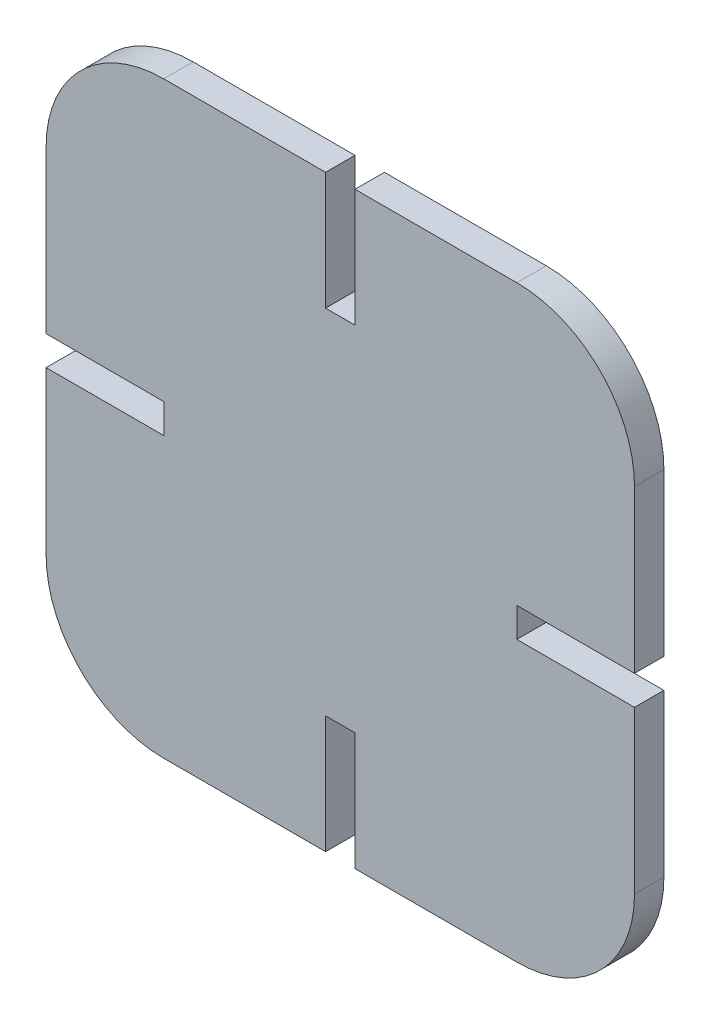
ISO-10303-21;
HEADER;
FILE_DESCRIPTION(('STEP AP214'),'2;1');
FILE_NAME('part.step','',(''),(''),'','','');
FILE_SCHEMA(('AUTOMOTIVE_DESIGN { 1 0 10303 214 1 1 1 1 }'));
ENDSEC;
DATA;
#1=APPLICATION_CONTEXT('core data for automotive mechanical design processes');
#2=APPLICATION_PROTOCOL_DEFINITION('international standard','automotive_design',2000,#1);
#3=PRODUCT_CONTEXT('',#1,'mechanical');
#4=PRODUCT('Part','Part','',(#3));
#5=PRODUCT_RELATED_PRODUCT_CATEGORY('part','',(#4));
#6=PRODUCT_DEFINITION_FORMATION('','',#4);
#7=PRODUCT_DEFINITION_CONTEXT('part definition',#1,'design');
#8=PRODUCT_DEFINITION('design','',#6,#7);
#9=PRODUCT_DEFINITION_SHAPE('','',#8);
#10=(LENGTH_UNIT() NAMED_UNIT(*) SI_UNIT(.MILLI.,.METRE.));
#11=(NAMED_UNIT(*) PLANE_ANGLE_UNIT() SI_UNIT($,.RADIAN.));
#12=(NAMED_UNIT(*) SI_UNIT($,.STERADIAN.) SOLID_ANGLE_UNIT());
#13=UNCERTAINTY_MEASURE_WITH_UNIT(LENGTH_MEASURE(1.E-05),#10,'distance_accuracy_value','');
#14=(GEOMETRIC_REPRESENTATION_CONTEXT(3) GLOBAL_UNCERTAINTY_ASSIGNED_CONTEXT((#13)) GLOBAL_UNIT_ASSIGNED_CONTEXT((#10,
#11,#12)) REPRESENTATION_CONTEXT('',''));
#15=CARTESIAN_POINT('',(0.,0.,0.));
#16=DIRECTION('',(0.,0.,1.));
#17=DIRECTION('',(1.,0.,0.));
#18=AXIS2_PLACEMENT_3D('',#15,#16,#17);
#19=CARTESIAN_POINT('',(-25.,15.,2.5));
#20=DIRECTION('',(1.,0.,0.));
#21=DIRECTION('',(0.,1.,0.));
#22=AXIS2_PLACEMENT_3D('',#19,#20,#21);
#23=PLANE('',#22);
#24=DIRECTION('',(0.,-1.,0.));
#25=VECTOR('',#24,1.);
#26=CARTESIAN_POINT('',(-25.,15.,2.5));
#27=LINE('',#26,#25);
#28=CARTESIAN_POINT('',(-24.9999999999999,-1.25000000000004,2.5));
#29=VERTEX_POINT('',#28);
#30=CARTESIAN_POINT('',(-25.,-15.,2.5));
#31=VERTEX_POINT('',#30);
#32=EDGE_CURVE('E308',#29,#31,#27,.T.);
#33=ORIENTED_EDGE('',*,*,#32,.F.);
#34=DIRECTION('',(0.,0.,1.));
#35=VECTOR('',#34,1.);
#36=CARTESIAN_POINT('',(-24.9999999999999,-1.25000000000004,0.));
#37=LINE('',#36,#35);
#38=CARTESIAN_POINT('',(-24.9999999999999,-1.25000000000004,0.));
#39=VERTEX_POINT('',#38);
#40=EDGE_CURVE('E275',#39,#29,#37,.T.);
#41=ORIENTED_EDGE('',*,*,#40,.F.);
#42=DIRECTION('',(0.,-1.,0.));
#43=VECTOR('',#42,1.);
#44=CARTESIAN_POINT('',(-25.,15.,0.));
#45=LINE('',#44,#43);
#46=CARTESIAN_POINT('',(-25.,-15.,0.));
#47=VERTEX_POINT('',#46);
#48=EDGE_CURVE('E337',#39,#47,#45,.T.);
#49=ORIENTED_EDGE('',*,*,#48,.T.);
#50=DIRECTION('',(0.,0.,-1.));
#51=VECTOR('',#50,1.);
#52=CARTESIAN_POINT('',(-25.,-15.,2.5));
#53=LINE('',#52,#51);
#54=EDGE_CURVE('E41',#31,#47,#53,.T.);
#55=ORIENTED_EDGE('',*,*,#54,.F.);
#56=EDGE_LOOP('',(#33,#41,#49,#55));
#57=FACE_BOUND('',#56,.T.);
#58=ADVANCED_FACE('F33',(#57),#23,.F.);
#59=CARTESIAN_POINT('',(-15.,-25.,2.5));
#60=DIRECTION('',(0.,1.,0.));
#61=DIRECTION('',(0.,0.,1.));
#62=AXIS2_PLACEMENT_3D('',#59,#60,#61);
#63=PLANE('',#62);
#64=DIRECTION('',(1.,0.,0.));
#65=VECTOR('',#64,1.);
#66=CARTESIAN_POINT('',(-15.,-25.,2.5));
#67=LINE('',#66,#65);
#68=CARTESIAN_POINT('',(1.25,-25.,2.5));
#69=VERTEX_POINT('',#68);
#70=CARTESIAN_POINT('',(15.,-25.,2.5));
#71=VERTEX_POINT('',#70);
#72=EDGE_CURVE('E316',#69,#71,#67,.T.);
#73=ORIENTED_EDGE('',*,*,#72,.F.);
#74=DIRECTION('',(0.,0.,1.));
#75=VECTOR('',#74,1.);
#76=CARTESIAN_POINT('',(1.25,-25.,0.));
#77=LINE('',#76,#75);
#78=CARTESIAN_POINT('',(1.25,-25.,0.));
#79=VERTEX_POINT('',#78);
#80=EDGE_CURVE('E253',#79,#69,#77,.T.);
#81=ORIENTED_EDGE('',*,*,#80,.F.);
#82=DIRECTION('',(1.,0.,0.));
#83=VECTOR('',#82,1.);
#84=CARTESIAN_POINT('',(-15.,-25.,0.));
#85=LINE('',#84,#83);
#86=CARTESIAN_POINT('',(15.,-25.,0.));
#87=VERTEX_POINT('',#86);
#88=EDGE_CURVE('E344',#79,#87,#85,.T.);
#89=ORIENTED_EDGE('',*,*,#88,.T.);
#90=DIRECTION('',(0.,0.,-1.));
#91=VECTOR('',#90,1.);
#92=CARTESIAN_POINT('',(15.,-25.,2.5));
#93=LINE('',#92,#91);
#94=EDGE_CURVE('E369',#71,#87,#93,.T.);
#95=ORIENTED_EDGE('',*,*,#94,.F.);
#96=EDGE_LOOP('',(#73,#81,#89,#95));
#97=FACE_BOUND('',#96,.T.);
#98=ADVANCED_FACE('F413',(#97),#63,.F.);
#99=CARTESIAN_POINT('',(25.,15.,2.5));
#100=DIRECTION('',(1.,0.,0.));
#101=DIRECTION('',(0.,1.,0.));
#102=AXIS2_PLACEMENT_3D('',#99,#100,#101);
#103=PLANE('',#102);
#104=DIRECTION('',(0.,0.,1.));
#105=VECTOR('',#104,1.);
#106=CARTESIAN_POINT('',(24.9999999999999,1.24999999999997,0.));
#107=LINE('',#106,#105);
#108=CARTESIAN_POINT('',(24.9999999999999,1.24999999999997,0.));
#109=VERTEX_POINT('',#108);
#110=CARTESIAN_POINT('',(24.9999999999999,1.24999999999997,2.5));
#111=VERTEX_POINT('',#110);
#112=EDGE_CURVE('E231',#109,#111,#107,.T.);
#113=ORIENTED_EDGE('',*,*,#112,.F.);
#114=DIRECTION('',(0.,-1.,0.));
#115=VECTOR('',#114,1.);
#116=CARTESIAN_POINT('',(25.,15.,0.));
#117=LINE('',#116,#115);
#118=CARTESIAN_POINT('',(25.,15.,0.));
#119=VERTEX_POINT('',#118);
#120=EDGE_CURVE('E352',#119,#109,#117,.T.);
#121=ORIENTED_EDGE('',*,*,#120,.F.);
#122=DIRECTION('',(0.,0.,-1.));
#123=VECTOR('',#122,1.);
#124=CARTESIAN_POINT('',(25.,15.,2.5));
#125=LINE('',#124,#123);
#126=CARTESIAN_POINT('',(25.,15.,2.5));
#127=VERTEX_POINT('',#126);
#128=EDGE_CURVE('E364',#127,#119,#125,.T.);
#129=ORIENTED_EDGE('',*,*,#128,.F.);
#130=DIRECTION('',(0.,-1.,0.));
#131=VECTOR('',#130,1.);
#132=CARTESIAN_POINT('',(25.,15.,2.5));
#133=LINE('',#132,#131);
#134=EDGE_CURVE('E324',#127,#111,#133,.T.);
#135=ORIENTED_EDGE('',*,*,#134,.T.);
#136=EDGE_LOOP('',(#113,#121,#129,#135));
#137=FACE_BOUND('',#136,.T.);
#138=ADVANCED_FACE('F418',(#137),#103,.T.);
#139=CARTESIAN_POINT('',(-15.,25.,2.5));
#140=DIRECTION('',(0.,1.,0.));
#141=DIRECTION('',(0.,0.,1.));
#142=AXIS2_PLACEMENT_3D('',#139,#140,#141);
#143=PLANE('',#142);
#144=DIRECTION('',(0.,0.,1.));
#145=VECTOR('',#144,1.);
#146=CARTESIAN_POINT('',(1.25,24.9999999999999,0.));
#147=LINE('',#146,#145);
#148=CARTESIAN_POINT('',(1.25,24.9999999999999,0.));
#149=VERTEX_POINT('',#148);
#150=CARTESIAN_POINT('',(1.25,24.9999999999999,2.5));
#151=VERTEX_POINT('',#150);
#152=EDGE_CURVE('E289',#149,#151,#147,.T.);
#153=ORIENTED_EDGE('',*,*,#152,.T.);
#154=DIRECTION('',(1.,0.,0.));
#155=VECTOR('',#154,1.);
#156=CARTESIAN_POINT('',(-15.,25.,2.5));
#157=LINE('',#156,#155);
#158=CARTESIAN_POINT('',(15.,25.,2.5));
#159=VERTEX_POINT('',#158);
#160=EDGE_CURVE('E330',#151,#159,#157,.T.);
#161=ORIENTED_EDGE('',*,*,#160,.T.);
#162=DIRECTION('',(0.,0.,-1.));
#163=VECTOR('',#162,1.);
#164=CARTESIAN_POINT('',(15.,25.,2.5));
#165=LINE('',#164,#163);
#166=CARTESIAN_POINT('',(15.,25.,0.));
#167=VERTEX_POINT('',#166);
#168=EDGE_CURVE('E361',#159,#167,#165,.T.);
#169=ORIENTED_EDGE('',*,*,#168,.T.);
#170=DIRECTION('',(1.,0.,0.));
#171=VECTOR('',#170,1.);
#172=CARTESIAN_POINT('',(-15.,25.,0.));
#173=LINE('',#172,#171);
#174=EDGE_CURVE('E357',#149,#167,#173,.T.);
#175=ORIENTED_EDGE('',*,*,#174,.F.);
#176=EDGE_LOOP('',(#153,#161,#169,#175));
#177=FACE_BOUND('',#176,.T.);
#178=ADVANCED_FACE('F428',(#177),#143,.T.);
#179=CARTESIAN_POINT('',(-15.,15.,2.5));
#180=DIRECTION('',(0.,0.,-1.));
#181=DIRECTION('',(-1.,0.,0.));
#182=AXIS2_PLACEMENT_3D('',#179,#180,#181);
#183=CYLINDRICAL_SURFACE('',#182,10.);
#184=CARTESIAN_POINT('',(-15.,15.,0.));
#185=DIRECTION('',(0.,0.,1.));
#186=DIRECTION('',(1.,0.,0.));
#187=AXIS2_PLACEMENT_3D('',#184,#185,#186);
#188=CIRCLE('',#187,10.);
#189=CARTESIAN_POINT('',(-15.,25.,0.));
#190=VERTEX_POINT('',#189);
#191=CARTESIAN_POINT('',(-25.,15.,0.));
#192=VERTEX_POINT('',#191);
#193=EDGE_CURVE('E298',#190,#192,#188,.T.);
#194=ORIENTED_EDGE('',*,*,#193,.T.);
#195=DIRECTION('',(0.,0.,-1.));
#196=VECTOR('',#195,1.);
#197=CARTESIAN_POINT('',(-25.,15.,2.5));
#198=LINE('',#197,#196);
#199=CARTESIAN_POINT('',(-25.,15.,2.5));
#200=VERTEX_POINT('',#199);
#201=EDGE_CURVE('E11',#200,#192,#198,.T.);
#202=ORIENTED_EDGE('',*,*,#201,.F.);
#203=CARTESIAN_POINT('',(-15.,15.,2.5));
#204=DIRECTION('',(0.,0.,1.));
#205=DIRECTION('',(1.,0.,0.));
#206=AXIS2_PLACEMENT_3D('',#203,#204,#205);
#207=CIRCLE('',#206,10.);
#208=CARTESIAN_POINT('',(-15.,25.,2.5));
#209=VERTEX_POINT('',#208);
#210=EDGE_CURVE('E305',#209,#200,#207,.T.);
#211=ORIENTED_EDGE('',*,*,#210,.F.);
#212=DIRECTION('',(0.,0.,-1.));
#213=VECTOR('',#212,1.);
#214=CARTESIAN_POINT('',(-15.,25.,2.5));
#215=LINE('',#214,#213);
#216=EDGE_CURVE('E334',#209,#190,#215,.T.);
#217=ORIENTED_EDGE('',*,*,#216,.T.);
#218=EDGE_LOOP('',(#194,#202,#211,#217));
#219=FACE_BOUND('',#218,.T.);
#220=ADVANCED_FACE('F35',(#219),#183,.T.);
#221=CARTESIAN_POINT('',(-25.,1.24999999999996,0.));
#222=VERTEX_POINT('',#221);
#223=EDGE_CURVE('E338',#192,#222,#45,.T.);
#224=ORIENTED_EDGE('',*,*,#223,.T.);
#225=DIRECTION('',(0.,0.,1.));
#226=VECTOR('',#225,1.);
#227=CARTESIAN_POINT('',(-24.9999999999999,1.24999999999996,0.));
#228=LINE('',#227,#226);
#229=CARTESIAN_POINT('',(-24.9999999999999,1.24999999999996,2.5));
#230=VERTEX_POINT('',#229);
#231=EDGE_CURVE('E48',#222,#230,#228,.T.);
#232=ORIENTED_EDGE('',*,*,#231,.T.);
#233=EDGE_CURVE('E310',#200,#230,#27,.T.);
#234=ORIENTED_EDGE('',*,*,#233,.F.);
#235=ORIENTED_EDGE('',*,*,#201,.T.);
#236=EDGE_LOOP('',(#224,#232,#234,#235));
#237=FACE_BOUND('',#236,.T.);
#238=ADVANCED_FACE('F414',(#237),#23,.F.);
#239=CARTESIAN_POINT('',(-15.,-15.,2.5));
#240=DIRECTION('',(0.,0.,-1.));
#241=DIRECTION('',(-1.,0.,0.));
#242=AXIS2_PLACEMENT_3D('',#239,#240,#241);
#243=CYLINDRICAL_SURFACE('',#242,10.);
#244=CARTESIAN_POINT('',(-15.,-15.,0.));
#245=DIRECTION('',(0.,0.,-1.));
#246=DIRECTION('',(-1.,0.,0.));
#247=AXIS2_PLACEMENT_3D('',#244,#245,#246);
#248=CIRCLE('',#247,10.);
#249=CARTESIAN_POINT('',(-15.,-25.,0.));
#250=VERTEX_POINT('',#249);
#251=EDGE_CURVE('E341',#250,#47,#248,.T.);
#252=ORIENTED_EDGE('',*,*,#251,.F.);
#253=DIRECTION('',(0.,0.,-1.));
#254=VECTOR('',#253,1.);
#255=CARTESIAN_POINT('',(-15.,-25.,2.5));
#256=LINE('',#255,#254);
#257=CARTESIAN_POINT('',(-15.,-25.,2.5));
#258=VERTEX_POINT('',#257);
#259=EDGE_CURVE('E372',#258,#250,#256,.T.);
#260=ORIENTED_EDGE('',*,*,#259,.F.);
#261=CARTESIAN_POINT('',(-15.,-15.,2.5));
#262=DIRECTION('',(0.,0.,-1.));
#263=DIRECTION('',(-1.,0.,0.));
#264=AXIS2_PLACEMENT_3D('',#261,#262,#263);
#265=CIRCLE('',#264,10.);
#266=EDGE_CURVE('E313',#258,#31,#265,.T.);
#267=ORIENTED_EDGE('',*,*,#266,.T.);
#268=ORIENTED_EDGE('',*,*,#54,.T.);
#269=EDGE_LOOP('',(#252,#260,#267,#268));
#270=FACE_BOUND('',#269,.T.);
#271=ADVANCED_FACE('F377',(#270),#243,.T.);
#272=CARTESIAN_POINT('',(-1.25,-25.,0.));
#273=VERTEX_POINT('',#272);
#274=EDGE_CURVE('E345',#250,#273,#85,.T.);
#275=ORIENTED_EDGE('',*,*,#274,.T.);
#276=DIRECTION('',(0.,0.,1.));
#277=VECTOR('',#276,1.);
#278=CARTESIAN_POINT('',(-1.25,-25.,0.));
#279=LINE('',#278,#277);
#280=CARTESIAN_POINT('',(-1.25,-25.,2.5));
#281=VERTEX_POINT('',#280);
#282=EDGE_CURVE('E56',#273,#281,#279,.T.);
#283=ORIENTED_EDGE('',*,*,#282,.T.);
#284=EDGE_CURVE('E317',#258,#281,#67,.T.);
#285=ORIENTED_EDGE('',*,*,#284,.F.);
#286=ORIENTED_EDGE('',*,*,#259,.T.);
#287=EDGE_LOOP('',(#275,#283,#285,#286));
#288=FACE_BOUND('',#287,.T.);
#289=ADVANCED_FACE('F384',(#288),#63,.F.);
#290=CARTESIAN_POINT('',(15.,-15.,2.5));
#291=DIRECTION('',(0.,0.,-1.));
#292=DIRECTION('',(-1.,0.,0.));
#293=AXIS2_PLACEMENT_3D('',#290,#291,#292);
#294=CYLINDRICAL_SURFACE('',#293,10.);
#295=CARTESIAN_POINT('',(15.,-15.,0.));
#296=DIRECTION('',(0.,0.,-1.));
#297=DIRECTION('',(-1.,0.,0.));
#298=AXIS2_PLACEMENT_3D('',#295,#296,#297);
#299=CIRCLE('',#298,10.);
#300=CARTESIAN_POINT('',(25.,-15.,0.));
#301=VERTEX_POINT('',#300);
#302=EDGE_CURVE('E348',#301,#87,#299,.T.);
#303=ORIENTED_EDGE('',*,*,#302,.F.);
#304=DIRECTION('',(0.,0.,-1.));
#305=VECTOR('',#304,1.);
#306=CARTESIAN_POINT('',(25.,-15.,2.5));
#307=LINE('',#306,#305);
#308=CARTESIAN_POINT('',(25.,-15.,2.5));
#309=VERTEX_POINT('',#308);
#310=EDGE_CURVE('E366',#309,#301,#307,.T.);
#311=ORIENTED_EDGE('',*,*,#310,.F.);
#312=CARTESIAN_POINT('',(15.,-15.,2.5));
#313=DIRECTION('',(0.,0.,-1.));
#314=DIRECTION('',(-1.,0.,0.));
#315=AXIS2_PLACEMENT_3D('',#312,#313,#314);
#316=CIRCLE('',#315,10.);
#317=EDGE_CURVE('E320',#309,#71,#316,.T.);
#318=ORIENTED_EDGE('',*,*,#317,.T.);
#319=ORIENTED_EDGE('',*,*,#94,.T.);
#320=EDGE_LOOP('',(#303,#311,#318,#319));
#321=FACE_BOUND('',#320,.T.);
#322=ADVANCED_FACE('F470',(#321),#294,.T.);
#323=DIRECTION('',(0.,0.,1.));
#324=VECTOR('',#323,1.);
#325=CARTESIAN_POINT('',(24.9999999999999,-1.25000000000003,0.));
#326=LINE('',#325,#324);
#327=CARTESIAN_POINT('',(25.,-1.25000000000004,0.));
#328=VERTEX_POINT('',#327);
#329=CARTESIAN_POINT('',(24.9999999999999,-1.25000000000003,2.5));
#330=VERTEX_POINT('',#329);
#331=EDGE_CURVE('E206',#328,#330,#326,.T.);
#332=ORIENTED_EDGE('',*,*,#331,.T.);
#333=EDGE_CURVE('E323',#330,#309,#133,.T.);
#334=ORIENTED_EDGE('',*,*,#333,.T.);
#335=ORIENTED_EDGE('',*,*,#310,.T.);
#336=EDGE_CURVE('E351',#328,#301,#117,.T.);
#337=ORIENTED_EDGE('',*,*,#336,.F.);
#338=EDGE_LOOP('',(#332,#334,#335,#337));
#339=FACE_BOUND('',#338,.T.);
#340=ADVANCED_FACE('F465',(#339),#103,.T.);
#341=CARTESIAN_POINT('',(15.,15.,2.5));
#342=DIRECTION('',(0.,0.,-1.));
#343=DIRECTION('',(-1.,0.,0.));
#344=AXIS2_PLACEMENT_3D('',#341,#342,#343);
#345=CYLINDRICAL_SURFACE('',#344,10.);
#346=CARTESIAN_POINT('',(15.,15.,0.));
#347=DIRECTION('',(0.,0.,1.));
#348=DIRECTION('',(1.,0.,0.));
#349=AXIS2_PLACEMENT_3D('',#346,#347,#348);
#350=CIRCLE('',#349,10.);
#351=EDGE_CURVE('E354',#119,#167,#350,.T.);
#352=ORIENTED_EDGE('',*,*,#351,.T.);
#353=ORIENTED_EDGE('',*,*,#168,.F.);
#354=CARTESIAN_POINT('',(15.,15.,2.5));
#355=DIRECTION('',(0.,0.,1.));
#356=DIRECTION('',(1.,0.,0.));
#357=AXIS2_PLACEMENT_3D('',#354,#355,#356);
#358=CIRCLE('',#357,10.);
#359=EDGE_CURVE('E327',#127,#159,#358,.T.);
#360=ORIENTED_EDGE('',*,*,#359,.F.);
#361=ORIENTED_EDGE('',*,*,#128,.T.);
#362=EDGE_LOOP('',(#352,#353,#360,#361));
#363=FACE_BOUND('',#362,.T.);
#364=ADVANCED_FACE('F455',(#363),#345,.T.);
#365=DIRECTION('',(0.,0.,1.));
#366=VECTOR('',#365,1.);
#367=CARTESIAN_POINT('',(-1.25,24.9999999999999,0.));
#368=LINE('',#367,#366);
#369=CARTESIAN_POINT('',(-1.25,24.9999999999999,0.));
#370=VERTEX_POINT('',#369);
#371=CARTESIAN_POINT('',(-1.25,24.9999999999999,2.5));
#372=VERTEX_POINT('',#371);
#373=EDGE_CURVE('E301',#370,#372,#368,.T.);
#374=ORIENTED_EDGE('',*,*,#373,.F.);
#375=EDGE_CURVE('E309',#190,#370,#173,.T.);
#376=ORIENTED_EDGE('',*,*,#375,.F.);
#377=ORIENTED_EDGE('',*,*,#216,.F.);
#378=EDGE_CURVE('E331',#209,#372,#157,.T.);
#379=ORIENTED_EDGE('',*,*,#378,.T.);
#380=EDGE_LOOP('',(#374,#376,#377,#379));
#381=FACE_BOUND('',#380,.T.);
#382=ADVANCED_FACE('F435',(#381),#143,.T.);
#383=CARTESIAN_POINT('',(-15.,15.,2.5));
#384=DIRECTION('',(0.,0.,1.));
#385=DIRECTION('',(1.,0.,0.));
#386=AXIS2_PLACEMENT_3D('',#383,#384,#385);
#387=PLANE('',#386);
#388=DIRECTION('',(-1.,0.,0.));
#389=VECTOR('',#388,1.);
#390=CARTESIAN_POINT('',(15.,1.24999999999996,2.5));
#391=LINE('',#390,#389);
#392=CARTESIAN_POINT('',(15.,1.24999999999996,2.5));
#393=VERTEX_POINT('',#392);
#394=EDGE_CURVE('E218',#111,#393,#391,.T.);
#395=ORIENTED_EDGE('',*,*,#394,.F.);
#396=ORIENTED_EDGE('',*,*,#134,.F.);
#397=ORIENTED_EDGE('',*,*,#359,.T.);
#398=ORIENTED_EDGE('',*,*,#160,.F.);
#399=DIRECTION('',(0.,1.,0.));
#400=VECTOR('',#399,1.);
#401=CARTESIAN_POINT('',(1.25,15.,2.5));
#402=LINE('',#401,#400);
#403=CARTESIAN_POINT('',(1.25,15.,2.5));
#404=VERTEX_POINT('',#403);
#405=EDGE_CURVE('E230',#404,#151,#402,.T.);
#406=ORIENTED_EDGE('',*,*,#405,.F.);
#407=DIRECTION('',(1.,0.,0.));
#408=VECTOR('',#407,1.);
#409=CARTESIAN_POINT('',(-1.25,15.,2.5));
#410=LINE('',#409,#408);
#411=CARTESIAN_POINT('',(-1.25,15.,2.5));
#412=VERTEX_POINT('',#411);
#413=EDGE_CURVE('E283',#412,#404,#410,.T.);
#414=ORIENTED_EDGE('',*,*,#413,.F.);
#415=DIRECTION('',(0.,-1.,0.));
#416=VECTOR('',#415,1.);
#417=CARTESIAN_POINT('',(-1.25,15.,2.5));
#418=LINE('',#417,#416);
#419=EDGE_CURVE('E291',#372,#412,#418,.T.);
#420=ORIENTED_EDGE('',*,*,#419,.F.);
#421=ORIENTED_EDGE('',*,*,#378,.F.);
#422=ORIENTED_EDGE('',*,*,#210,.T.);
#423=ORIENTED_EDGE('',*,*,#233,.T.);
#424=DIRECTION('',(-1.,0.,0.));
#425=VECTOR('',#424,1.);
#426=CARTESIAN_POINT('',(-15.,1.24999999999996,2.5));
#427=LINE('',#426,#425);
#428=CARTESIAN_POINT('',(-15.,1.24999999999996,2.5));
#429=VERTEX_POINT('',#428);
#430=EDGE_CURVE('E270',#429,#230,#427,.T.);
#431=ORIENTED_EDGE('',*,*,#430,.F.);
#432=DIRECTION('',(0.,1.,0.));
#433=VECTOR('',#432,1.);
#434=CARTESIAN_POINT('',(-15.,-1.25000000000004,2.5));
#435=LINE('',#434,#433);
#436=CARTESIAN_POINT('',(-15.,-1.25000000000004,2.5));
#437=VERTEX_POINT('',#436);
#438=EDGE_CURVE('E267',#437,#429,#435,.T.);
#439=ORIENTED_EDGE('',*,*,#438,.F.);
#440=DIRECTION('',(1.,0.,0.));
#441=VECTOR('',#440,1.);
#442=CARTESIAN_POINT('',(-15.,-1.25000000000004,2.5));
#443=LINE('',#442,#441);
#444=EDGE_CURVE('E261',#29,#437,#443,.T.);
#445=ORIENTED_EDGE('',*,*,#444,.F.);
#446=ORIENTED_EDGE('',*,*,#32,.T.);
#447=ORIENTED_EDGE('',*,*,#266,.F.);
#448=ORIENTED_EDGE('',*,*,#284,.T.);
#449=DIRECTION('',(0.,-1.,0.));
#450=VECTOR('',#449,1.);
#451=CARTESIAN_POINT('',(-1.25,-15.,2.5));
#452=LINE('',#451,#450);
#453=CARTESIAN_POINT('',(-1.25,-15.,2.5));
#454=VERTEX_POINT('',#453);
#455=EDGE_CURVE('E247',#454,#281,#452,.T.);
#456=ORIENTED_EDGE('',*,*,#455,.F.);
#457=DIRECTION('',(-1.,0.,0.));
#458=VECTOR('',#457,1.);
#459=CARTESIAN_POINT('',(1.25,-15.,2.5));
#460=LINE('',#459,#458);
#461=CARTESIAN_POINT('',(1.25,-15.,2.5));
#462=VERTEX_POINT('',#461);
#463=EDGE_CURVE('E244',#462,#454,#460,.T.);
#464=ORIENTED_EDGE('',*,*,#463,.F.);
#465=DIRECTION('',(0.,1.,0.));
#466=VECTOR('',#465,1.);
#467=CARTESIAN_POINT('',(1.25,-15.,2.5));
#468=LINE('',#467,#466);
#469=EDGE_CURVE('E238',#69,#462,#468,.T.);
#470=ORIENTED_EDGE('',*,*,#469,.F.);
#471=ORIENTED_EDGE('',*,*,#72,.T.);
#472=ORIENTED_EDGE('',*,*,#317,.F.);
#473=ORIENTED_EDGE('',*,*,#333,.F.);
#474=DIRECTION('',(1.,0.,0.));
#475=VECTOR('',#474,1.);
#476=CARTESIAN_POINT('',(15.,-1.25000000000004,2.5));
#477=LINE('',#476,#475);
#478=CARTESIAN_POINT('',(15.,-1.25000000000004,2.5));
#479=VERTEX_POINT('',#478);
#480=EDGE_CURVE('E221',#479,#330,#477,.T.);
#481=ORIENTED_EDGE('',*,*,#480,.F.);
#482=DIRECTION('',(0.,-1.,0.));
#483=VECTOR('',#482,1.);
#484=CARTESIAN_POINT('',(15.,1.24999999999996,2.5));
#485=LINE('',#484,#483);
#486=EDGE_CURVE('E203',#393,#479,#485,.T.);
#487=ORIENTED_EDGE('',*,*,#486,.F.);
#488=EDGE_LOOP('',(#395,#396,#397,#398,#406,#414,#420,#421,#422,#423,#431,#439,#445,#446,#447,
#448,#456,#464,#470,#471,#472,#473,#481,#487));
#489=FACE_BOUND('',#488,.T.);
#490=ADVANCED_FACE('F389',(#489),#387,.T.);
#491=CARTESIAN_POINT('',(-15.,15.,0.));
#492=DIRECTION('',(0.,0.,1.));
#493=DIRECTION('',(1.,0.,0.));
#494=AXIS2_PLACEMENT_3D('',#491,#492,#493);
#495=PLANE('',#494);
#496=ORIENTED_EDGE('',*,*,#120,.T.);
#497=DIRECTION('',(-1.,0.,0.));
#498=VECTOR('',#497,1.);
#499=CARTESIAN_POINT('',(15.,1.24999999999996,0.));
#500=LINE('',#499,#498);
#501=CARTESIAN_POINT('',(15.,1.24999999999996,0.));
#502=VERTEX_POINT('',#501);
#503=EDGE_CURVE('E207',#109,#502,#500,.T.);
#504=ORIENTED_EDGE('',*,*,#503,.T.);
#505=DIRECTION('',(0.,-1.,0.));
#506=VECTOR('',#505,1.);
#507=CARTESIAN_POINT('',(15.,1.24999999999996,0.));
#508=LINE('',#507,#506);
#509=CARTESIAN_POINT('',(15.,-1.25000000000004,0.));
#510=VERTEX_POINT('',#509);
#511=EDGE_CURVE('E200',#502,#510,#508,.T.);
#512=ORIENTED_EDGE('',*,*,#511,.T.);
#513=DIRECTION('',(1.,0.,0.));
#514=VECTOR('',#513,1.);
#515=CARTESIAN_POINT('',(15.,-1.25000000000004,0.));
#516=LINE('',#515,#514);
#517=EDGE_CURVE('E210',#510,#328,#516,.T.);
#518=ORIENTED_EDGE('',*,*,#517,.T.);
#519=ORIENTED_EDGE('',*,*,#336,.T.);
#520=ORIENTED_EDGE('',*,*,#302,.T.);
#521=ORIENTED_EDGE('',*,*,#88,.F.);
#522=DIRECTION('',(0.,1.,0.));
#523=VECTOR('',#522,1.);
#524=CARTESIAN_POINT('',(1.25,-15.,0.));
#525=LINE('',#524,#523);
#526=CARTESIAN_POINT('',(1.25,-15.,0.));
#527=VERTEX_POINT('',#526);
#528=EDGE_CURVE('E240',#79,#527,#525,.T.);
#529=ORIENTED_EDGE('',*,*,#528,.T.);
#530=DIRECTION('',(-1.,0.,0.));
#531=VECTOR('',#530,1.);
#532=CARTESIAN_POINT('',(1.25,-15.,0.));
#533=LINE('',#532,#531);
#534=CARTESIAN_POINT('',(-1.25,-15.,0.));
#535=VERTEX_POINT('',#534);
#536=EDGE_CURVE('E234',#527,#535,#533,.T.);
#537=ORIENTED_EDGE('',*,*,#536,.T.);
#538=DIRECTION('',(0.,-1.,0.));
#539=VECTOR('',#538,1.);
#540=CARTESIAN_POINT('',(-1.25,-15.,0.));
#541=LINE('',#540,#539);
#542=EDGE_CURVE('E237',#535,#273,#541,.T.);
#543=ORIENTED_EDGE('',*,*,#542,.T.);
#544=ORIENTED_EDGE('',*,*,#274,.F.);
#545=ORIENTED_EDGE('',*,*,#251,.T.);
#546=ORIENTED_EDGE('',*,*,#48,.F.);
#547=DIRECTION('',(1.,0.,0.));
#548=VECTOR('',#547,1.);
#549=CARTESIAN_POINT('',(-15.,-1.25000000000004,0.));
#550=LINE('',#549,#548);
#551=CARTESIAN_POINT('',(-15.,-1.25000000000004,0.));
#552=VERTEX_POINT('',#551);
#553=EDGE_CURVE('E263',#39,#552,#550,.T.);
#554=ORIENTED_EDGE('',*,*,#553,.T.);
#555=DIRECTION('',(0.,1.,0.));
#556=VECTOR('',#555,1.);
#557=CARTESIAN_POINT('',(-15.,-1.25000000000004,0.));
#558=LINE('',#557,#556);
#559=CARTESIAN_POINT('',(-15.,1.24999999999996,0.));
#560=VERTEX_POINT('',#559);
#561=EDGE_CURVE('E257',#552,#560,#558,.T.);
#562=ORIENTED_EDGE('',*,*,#561,.T.);
#563=DIRECTION('',(-1.,0.,0.));
#564=VECTOR('',#563,1.);
#565=CARTESIAN_POINT('',(-15.,1.24999999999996,0.));
#566=LINE('',#565,#564);
#567=EDGE_CURVE('E260',#560,#222,#566,.T.);
#568=ORIENTED_EDGE('',*,*,#567,.T.);
#569=ORIENTED_EDGE('',*,*,#223,.F.);
#570=ORIENTED_EDGE('',*,*,#193,.F.);
#571=ORIENTED_EDGE('',*,*,#375,.T.);
#572=DIRECTION('',(0.,-1.,0.));
#573=VECTOR('',#572,1.);
#574=CARTESIAN_POINT('',(-1.25,15.,0.));
#575=LINE('',#574,#573);
#576=CARTESIAN_POINT('',(-1.25,15.,0.));
#577=VERTEX_POINT('',#576);
#578=EDGE_CURVE('E282',#370,#577,#575,.T.);
#579=ORIENTED_EDGE('',*,*,#578,.T.);
#580=DIRECTION('',(1.,0.,0.));
#581=VECTOR('',#580,1.);
#582=CARTESIAN_POINT('',(-1.25,15.,0.));
#583=LINE('',#582,#581);
#584=CARTESIAN_POINT('',(1.25,15.,0.));
#585=VERTEX_POINT('',#584);
#586=EDGE_CURVE('E286',#577,#585,#583,.T.);
#587=ORIENTED_EDGE('',*,*,#586,.T.);
#588=DIRECTION('',(0.,1.,0.));
#589=VECTOR('',#588,1.);
#590=CARTESIAN_POINT('',(1.25,15.,0.));
#591=LINE('',#590,#589);
#592=EDGE_CURVE('E279',#585,#149,#591,.T.);
#593=ORIENTED_EDGE('',*,*,#592,.T.);
#594=ORIENTED_EDGE('',*,*,#174,.T.);
#595=ORIENTED_EDGE('',*,*,#351,.F.);
#596=EDGE_LOOP('',(#496,#504,#512,#518,#519,#520,#521,#529,#537,#543,#544,#545,#546,#554,#562,
#568,#569,#570,#571,#579,#587,#593,#594,#595));
#597=FACE_BOUND('',#596,.T.);
#598=ADVANCED_FACE('F217',(#597),#495,.F.);
#599=CARTESIAN_POINT('',(1.25,15.,0.));
#600=DIRECTION('',(1.,0.,0.));
#601=DIRECTION('',(0.,1.,0.));
#602=AXIS2_PLACEMENT_3D('',#599,#600,#601);
#603=PLANE('',#602);
#604=ORIENTED_EDGE('',*,*,#405,.T.);
#605=ORIENTED_EDGE('',*,*,#152,.F.);
#606=ORIENTED_EDGE('',*,*,#592,.F.);
#607=DIRECTION('',(0.,0.,1.));
#608=VECTOR('',#607,1.);
#609=CARTESIAN_POINT('',(1.25,15.,0.));
#610=LINE('',#609,#608);
#611=EDGE_CURVE('E296',#585,#404,#610,.T.);
#612=ORIENTED_EDGE('',*,*,#611,.T.);
#613=EDGE_LOOP('',(#604,#605,#606,#612));
#614=FACE_BOUND('',#613,.T.);
#615=ADVANCED_FACE('F551',(#614),#603,.F.);
#616=CARTESIAN_POINT('',(-1.25,15.,0.));
#617=DIRECTION('',(0.,-1.,0.));
#618=DIRECTION('',(0.,0.,-1.));
#619=AXIS2_PLACEMENT_3D('',#616,#617,#618);
#620=PLANE('',#619);
#621=ORIENTED_EDGE('',*,*,#413,.T.);
#622=ORIENTED_EDGE('',*,*,#611,.F.);
#623=ORIENTED_EDGE('',*,*,#586,.F.);
#624=DIRECTION('',(0.,0.,1.));
#625=VECTOR('',#624,1.);
#626=CARTESIAN_POINT('',(-1.25,15.,0.));
#627=LINE('',#626,#625);
#628=EDGE_CURVE('E299',#577,#412,#627,.T.);
#629=ORIENTED_EDGE('',*,*,#628,.T.);
#630=EDGE_LOOP('',(#621,#622,#623,#629));
#631=FACE_BOUND('',#630,.T.);
#632=ADVANCED_FACE('F446',(#631),#620,.F.);
#633=CARTESIAN_POINT('',(-1.25,15.,0.));
#634=DIRECTION('',(-1.,0.,0.));
#635=DIRECTION('',(0.,-1.,0.));
#636=AXIS2_PLACEMENT_3D('',#633,#634,#635);
#637=PLANE('',#636);
#638=ORIENTED_EDGE('',*,*,#419,.T.);
#639=ORIENTED_EDGE('',*,*,#628,.F.);
#640=ORIENTED_EDGE('',*,*,#578,.F.);
#641=ORIENTED_EDGE('',*,*,#373,.T.);
#642=EDGE_LOOP('',(#638,#639,#640,#641));
#643=FACE_BOUND('',#642,.T.);
#644=ADVANCED_FACE('F440',(#643),#637,.F.);
#645=CARTESIAN_POINT('',(-15.,-1.25000000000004,0.));
#646=DIRECTION('',(1.,0.,0.));
#647=DIRECTION('',(0.,0.,-1.));
#648=AXIS2_PLACEMENT_3D('',#645,#646,#647);
#649=PLANE('',#648);
#650=ORIENTED_EDGE('',*,*,#438,.T.);
#651=DIRECTION('',(0.,0.,1.));
#652=VECTOR('',#651,1.);
#653=CARTESIAN_POINT('',(-15.,1.24999999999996,0.));
#654=LINE('',#653,#652);
#655=EDGE_CURVE('E266',#560,#429,#654,.T.);
#656=ORIENTED_EDGE('',*,*,#655,.F.);
#657=ORIENTED_EDGE('',*,*,#561,.F.);
#658=DIRECTION('',(0.,0.,1.));
#659=VECTOR('',#658,1.);
#660=CARTESIAN_POINT('',(-15.,-1.25000000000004,0.));
#661=LINE('',#660,#659);
#662=EDGE_CURVE('E248',#552,#437,#661,.T.);
#663=ORIENTED_EDGE('',*,*,#662,.T.);
#664=EDGE_LOOP('',(#650,#656,#657,#663));
#665=FACE_BOUND('',#664,.T.);
#666=ADVANCED_FACE('F397',(#665),#649,.F.);
#667=CARTESIAN_POINT('',(-15.,-1.25000000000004,0.));
#668=DIRECTION('',(0.,-1.,0.));
#669=DIRECTION('',(1.,0.,0.));
#670=AXIS2_PLACEMENT_3D('',#667,#668,#669);
#671=PLANE('',#670);
#672=ORIENTED_EDGE('',*,*,#444,.T.);
#673=ORIENTED_EDGE('',*,*,#662,.F.);
#674=ORIENTED_EDGE('',*,*,#553,.F.);
#675=ORIENTED_EDGE('',*,*,#40,.T.);
#676=EDGE_LOOP('',(#672,#673,#674,#675));
#677=FACE_BOUND('',#676,.T.);
#678=ADVANCED_FACE('F394',(#677),#671,.F.);
#679=CARTESIAN_POINT('',(-15.,1.24999999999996,0.));
#680=DIRECTION('',(0.,1.,0.));
#681=DIRECTION('',(-1.,0.,0.));
#682=AXIS2_PLACEMENT_3D('',#679,#680,#681);
#683=PLANE('',#682);
#684=ORIENTED_EDGE('',*,*,#430,.T.);
#685=ORIENTED_EDGE('',*,*,#231,.F.);
#686=ORIENTED_EDGE('',*,*,#567,.F.);
#687=ORIENTED_EDGE('',*,*,#655,.T.);
#688=EDGE_LOOP('',(#684,#685,#686,#687));
#689=FACE_BOUND('',#688,.T.);
#690=ADVANCED_FACE('F399',(#689),#683,.F.);
#691=CARTESIAN_POINT('',(1.25,-15.,0.));
#692=DIRECTION('',(0.,1.,0.));
#693=DIRECTION('',(0.,0.,1.));
#694=AXIS2_PLACEMENT_3D('',#691,#692,#693);
#695=PLANE('',#694);
#696=ORIENTED_EDGE('',*,*,#463,.T.);
#697=DIRECTION('',(0.,0.,1.));
#698=VECTOR('',#697,1.);
#699=CARTESIAN_POINT('',(-1.25,-15.,0.));
#700=LINE('',#699,#698);
#701=EDGE_CURVE('E243',#535,#454,#700,.T.);
#702=ORIENTED_EDGE('',*,*,#701,.F.);
#703=ORIENTED_EDGE('',*,*,#536,.F.);
#704=DIRECTION('',(0.,0.,1.));
#705=VECTOR('',#704,1.);
#706=CARTESIAN_POINT('',(1.25,-15.,0.));
#707=LINE('',#706,#705);
#708=EDGE_CURVE('E226',#527,#462,#707,.T.);
#709=ORIENTED_EDGE('',*,*,#708,.T.);
#710=EDGE_LOOP('',(#696,#702,#703,#709));
#711=FACE_BOUND('',#710,.T.);
#712=ADVANCED_FACE('F401',(#711),#695,.F.);
#713=CARTESIAN_POINT('',(1.25,-15.,0.));
#714=DIRECTION('',(1.,0.,0.));
#715=DIRECTION('',(0.,1.,0.));
#716=AXIS2_PLACEMENT_3D('',#713,#714,#715);
#717=PLANE('',#716);
#718=ORIENTED_EDGE('',*,*,#469,.T.);
#719=ORIENTED_EDGE('',*,*,#708,.F.);
#720=ORIENTED_EDGE('',*,*,#528,.F.);
#721=ORIENTED_EDGE('',*,*,#80,.T.);
#722=EDGE_LOOP('',(#718,#719,#720,#721));
#723=FACE_BOUND('',#722,.T.);
#724=ADVANCED_FACE('F407',(#723),#717,.F.);
#725=CARTESIAN_POINT('',(-1.25,-15.,0.));
#726=DIRECTION('',(-1.,0.,0.));
#727=DIRECTION('',(0.,-1.,0.));
#728=AXIS2_PLACEMENT_3D('',#725,#726,#727);
#729=PLANE('',#728);
#730=ORIENTED_EDGE('',*,*,#455,.T.);
#731=ORIENTED_EDGE('',*,*,#282,.F.);
#732=ORIENTED_EDGE('',*,*,#542,.F.);
#733=ORIENTED_EDGE('',*,*,#701,.T.);
#734=EDGE_LOOP('',(#730,#731,#732,#733));
#735=FACE_BOUND('',#734,.T.);
#736=ADVANCED_FACE('F478',(#735),#729,.F.);
#737=CARTESIAN_POINT('',(15.,1.24999999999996,0.));
#738=DIRECTION('',(-1.,0.,0.));
#739=DIRECTION('',(0.,0.,1.));
#740=AXIS2_PLACEMENT_3D('',#737,#738,#739);
#741=PLANE('',#740);
#742=ORIENTED_EDGE('',*,*,#486,.T.);
#743=DIRECTION('',(0.,0.,1.));
#744=VECTOR('',#743,1.);
#745=CARTESIAN_POINT('',(15.,-1.25000000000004,0.));
#746=LINE('',#745,#744);
#747=EDGE_CURVE('E196',#510,#479,#746,.T.);
#748=ORIENTED_EDGE('',*,*,#747,.F.);
#749=ORIENTED_EDGE('',*,*,#511,.F.);
#750=DIRECTION('',(0.,0.,1.));
#751=VECTOR('',#750,1.);
#752=CARTESIAN_POINT('',(15.,1.24999999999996,0.));
#753=LINE('',#752,#751);
#754=EDGE_CURVE('E228',#502,#393,#753,.T.);
#755=ORIENTED_EDGE('',*,*,#754,.T.);
#756=EDGE_LOOP('',(#742,#748,#749,#755));
#757=FACE_BOUND('',#756,.T.);
#758=ADVANCED_FACE('F198',(#757),#741,.F.);
#759=CARTESIAN_POINT('',(15.,1.24999999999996,0.));
#760=DIRECTION('',(0.,1.,0.));
#761=DIRECTION('',(-1.,0.,0.));
#762=AXIS2_PLACEMENT_3D('',#759,#760,#761);
#763=PLANE('',#762);
#764=ORIENTED_EDGE('',*,*,#394,.T.);
#765=ORIENTED_EDGE('',*,*,#754,.F.);
#766=ORIENTED_EDGE('',*,*,#503,.F.);
#767=ORIENTED_EDGE('',*,*,#112,.T.);
#768=EDGE_LOOP('',(#764,#765,#766,#767));
#769=FACE_BOUND('',#768,.T.);
#770=ADVANCED_FACE('F461',(#769),#763,.F.);
#771=CARTESIAN_POINT('',(15.,-1.25000000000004,0.));
#772=DIRECTION('',(0.,-1.,0.));
#773=DIRECTION('',(1.,0.,0.));
#774=AXIS2_PLACEMENT_3D('',#771,#772,#773);
#775=PLANE('',#774);
#776=ORIENTED_EDGE('',*,*,#480,.T.);
#777=ORIENTED_EDGE('',*,*,#331,.F.);
#778=ORIENTED_EDGE('',*,*,#517,.F.);
#779=ORIENTED_EDGE('',*,*,#747,.T.);
#780=EDGE_LOOP('',(#776,#777,#778,#779));
#781=FACE_BOUND('',#780,.T.);
#782=ADVANCED_FACE('F211',(#781),#775,.F.);
#783=CLOSED_SHELL('',(#58,#98,#138,#178,#220,#238,#271,#289,#322,#340,#364,#382,#490,#598,#615,
#632,#644,#666,#678,#690,#712,#724,#736,#758,#770,#782));
#784=MANIFOLD_SOLID_BREP('B2',#783);
#785=ADVANCED_BREP_SHAPE_REPRESENTATION('',(#18,#784),#14);
#786=SHAPE_DEFINITION_REPRESENTATION(#9,#785);
ENDSEC;
END-ISO-10303-21;
